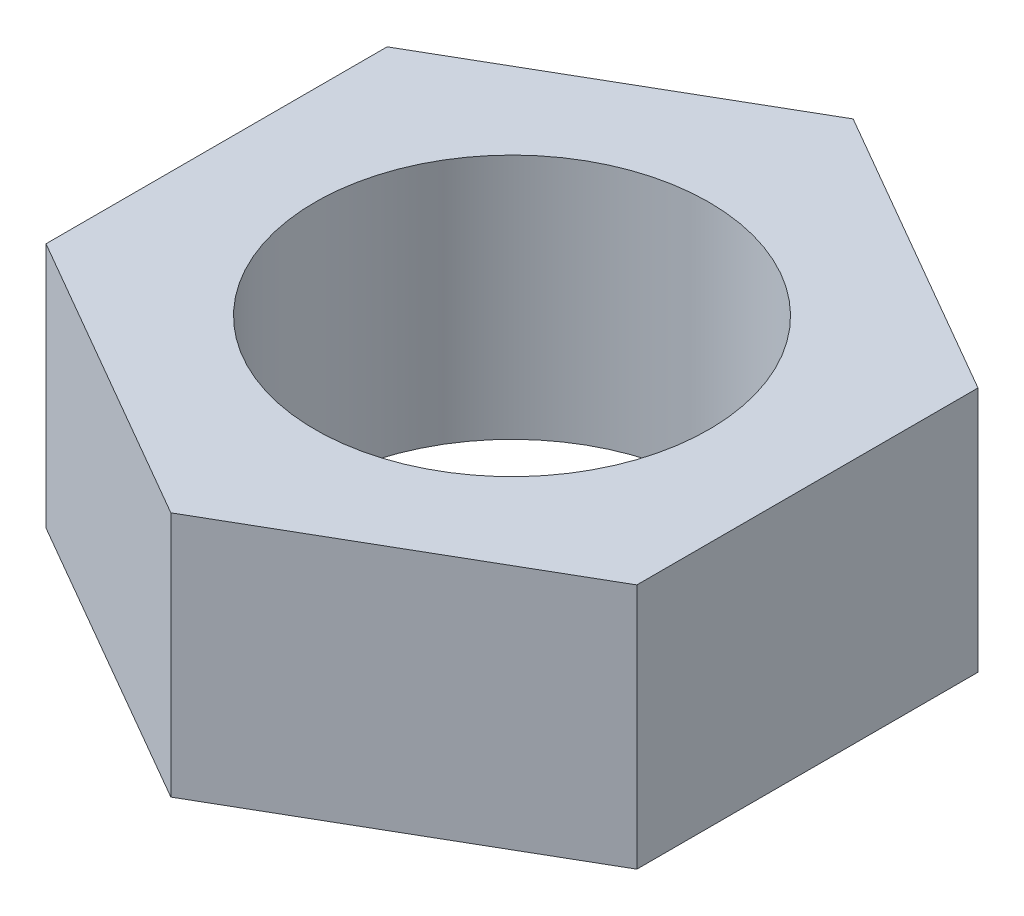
from build123d import *

# Parameters (mm, degrees)
BASE_EXTRUDE_DEPTH = 7.9375
SKETCH4_R          = 6.35
CUT_EXTRUDE1_DEPTH = 17.573986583


with BuildPart() as part:
    # Sketch3 → Base-Extrude (new body)
    with BuildSketch(Plane(origin=(0, 0, 0), x_dir=(1, 0, 0), z_dir=(0, 1, 0))):
        Polygon((0, 10.998522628), (-9.525, 5.499261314), (-9.525, -5.499261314), (0, -10.998522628), (9.525, -5.499261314), (9.525, 5.499261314), align=None)
    extrude(amount=BASE_EXTRUDE_DEPTH)

    # Sketch4 → Cut-Extrude1 (cut, through all)
    with BuildSketch(Plane.XZ):
        with Locations(Location((0, 0, 0), (0, 0, 270))):
            Circle(SKETCH4_R)
    extrude(amount=-CUT_EXTRUDE1_DEPTH, mode=Mode.SUBTRACT)


solid = part.part
